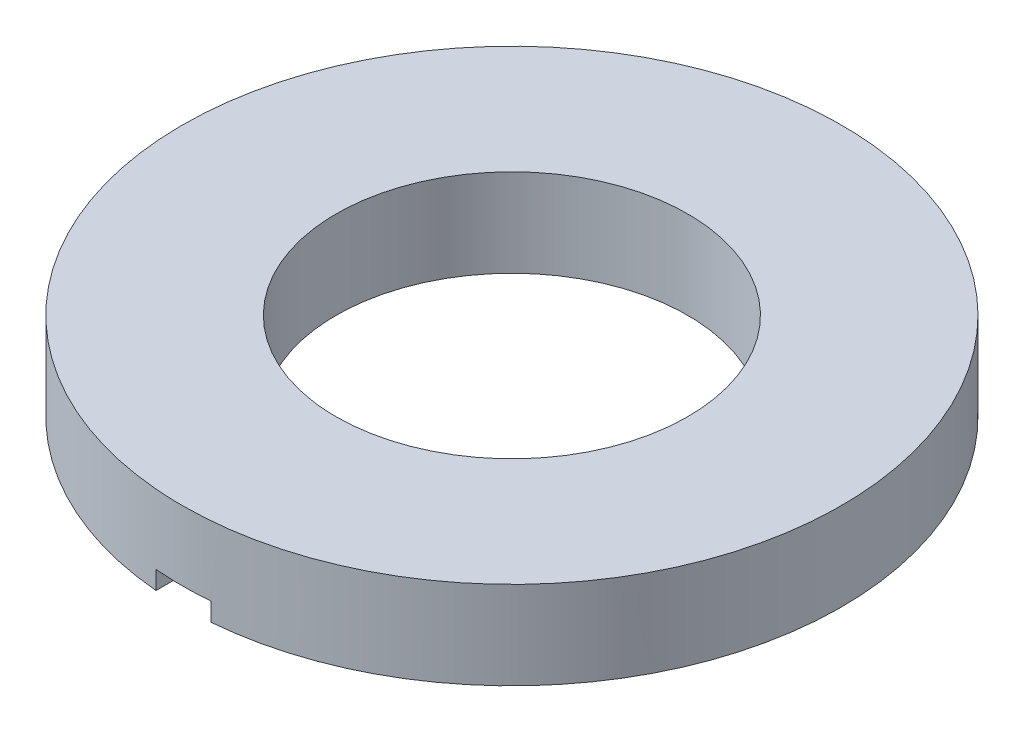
from build123d import *

# Parameters (mm, degrees)
SKETCH1_R          = 6
SKETCH1_R_2        = 3.2
EXTRUDE1_DEPTH     = 1.6
SKETCH2_W          = 1
SKETCH2_H          = 5.6
CUT_EXTRUDE1_DEPTH = 0.333333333


with BuildPart() as part:
    # Sketch1 → Extrude1 (new body)
    with BuildSketch(Plane(origin=(0, 0, 0), x_dir=(1, 0, 0), z_dir=(0, 1, 0))):
        with Locations(Location((0, 0, 0), (0, 0, 270))):
            Circle(SKETCH1_R)
        with Locations(Location((0, 0, 0), (0, 0, 270))):
            Circle(SKETCH1_R_2, mode=Mode.SUBTRACT)
    extrude(amount=EXTRUDE1_DEPTH)

    # Sketch2 → Cut-Extrude1 (cut)
    with BuildSketch(Plane.XZ):
        with Locations((0, 3.2)):
            Rectangle(SKETCH2_W, SKETCH2_H)
    extrude(amount=-CUT_EXTRUDE1_DEPTH, mode=Mode.SUBTRACT)


solid = part.part
